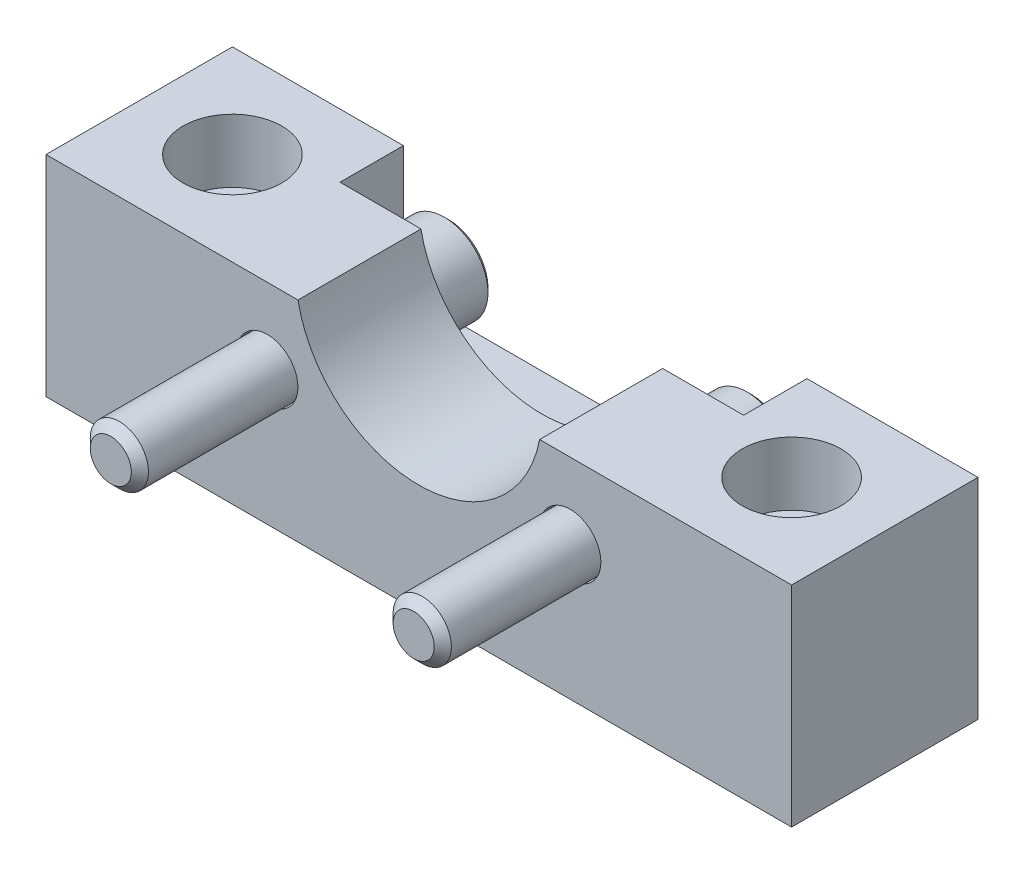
ISO-10303-21;
HEADER;
FILE_DESCRIPTION(('STEP AP214'),'2;1');
FILE_NAME('part.step','',(''),(''),'','','');
FILE_SCHEMA(('AUTOMOTIVE_DESIGN { 1 0 10303 214 1 1 1 1 }'));
ENDSEC;
DATA;
#1=APPLICATION_CONTEXT('core data for automotive mechanical design processes');
#2=APPLICATION_PROTOCOL_DEFINITION('international standard','automotive_design',2000,#1);
#3=PRODUCT_CONTEXT('',#1,'mechanical');
#4=PRODUCT('Part','Part','',(#3));
#5=PRODUCT_RELATED_PRODUCT_CATEGORY('part','',(#4));
#6=PRODUCT_DEFINITION_FORMATION('','',#4);
#7=PRODUCT_DEFINITION_CONTEXT('part definition',#1,'design');
#8=PRODUCT_DEFINITION('design','',#6,#7);
#9=PRODUCT_DEFINITION_SHAPE('','',#8);
#10=(LENGTH_UNIT() NAMED_UNIT(*) SI_UNIT(.MILLI.,.METRE.));
#11=(NAMED_UNIT(*) PLANE_ANGLE_UNIT() SI_UNIT($,.RADIAN.));
#12=(NAMED_UNIT(*) SI_UNIT($,.STERADIAN.) SOLID_ANGLE_UNIT());
#13=UNCERTAINTY_MEASURE_WITH_UNIT(LENGTH_MEASURE(1.E-05),#10,'distance_accuracy_value','');
#14=(GEOMETRIC_REPRESENTATION_CONTEXT(3) GLOBAL_UNCERTAINTY_ASSIGNED_CONTEXT((#13)) GLOBAL_UNIT_ASSIGNED_CONTEXT((#10,
#11,#12)) REPRESENTATION_CONTEXT('',''));
#15=CARTESIAN_POINT('',(0.,0.,0.));
#16=DIRECTION('',(0.,0.,1.));
#17=DIRECTION('',(1.,0.,0.));
#18=AXIS2_PLACEMENT_3D('',#15,#16,#17);
#19=CARTESIAN_POINT('',(-15.138238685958,-26.1874000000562,-20.8661));
#20=DIRECTION('',(0.,0.,1.));
#21=DIRECTION('',(0.5,0.866025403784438,0.));
#22=AXIS2_PLACEMENT_3D('',#19,#20,#21);
#23=PLANE('',#22);
#24=DIRECTION('',(-0.5,-0.866025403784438,0.));
#25=VECTOR('',#24,1.);
#26=CARTESIAN_POINT('',(-16.9713257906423,-29.3624000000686,-20.8661));
#27=LINE('',#26,#25);
#28=CARTESIAN_POINT('',(-16.9713257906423,-29.3624000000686,-20.8661));
#29=VERTEX_POINT('',#28);
#30=CARTESIAN_POINT('',(-18.8044128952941,-32.537400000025,-20.8661));
#31=VERTEX_POINT('',#30);
#32=EDGE_CURVE('E393',#29,#31,#27,.T.);
#33=ORIENTED_EDGE('',*,*,#32,.T.);
#34=DIRECTION('',(-1.,0.,0.));
#35=VECTOR('',#34,1.);
#36=CARTESIAN_POINT('',(-18.8044128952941,-32.537400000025,-20.8661));
#37=LINE('',#36,#35);
#38=CARTESIAN_POINT('',(-22.4705871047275,-32.537400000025,-20.8661));
#39=VERTEX_POINT('',#38);
#40=EDGE_CURVE('E396',#31,#39,#37,.T.);
#41=ORIENTED_EDGE('',*,*,#40,.T.);
#42=DIRECTION('',(-0.5,0.866025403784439,0.));
#43=VECTOR('',#42,1.);
#44=CARTESIAN_POINT('',(-22.4705871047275,-32.537400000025,-20.8661));
#45=LINE('',#44,#43);
#46=CARTESIAN_POINT('',(-24.3036742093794,-29.3624000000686,-20.8661));
#47=VERTEX_POINT('',#46);
#48=EDGE_CURVE('E399',#39,#47,#45,.T.);
#49=ORIENTED_EDGE('',*,*,#48,.T.);
#50=DIRECTION('',(0.5,0.866025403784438,0.));
#51=VECTOR('',#50,1.);
#52=CARTESIAN_POINT('',(-24.3036742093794,-29.3624000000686,-20.8661));
#53=LINE('',#52,#51);
#54=CARTESIAN_POINT('',(-22.4705871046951,-26.1874000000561,-20.8661));
#55=VERTEX_POINT('',#54);
#56=EDGE_CURVE('E402',#47,#55,#53,.T.);
#57=ORIENTED_EDGE('',*,*,#56,.T.);
#58=DIRECTION('',(1.,0.,0.));
#59=VECTOR('',#58,1.);
#60=CARTESIAN_POINT('',(-22.4705871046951,-26.1874000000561,-20.8661));
#61=LINE('',#60,#59);
#62=CARTESIAN_POINT('',(-18.8044128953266,-26.1874000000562,-20.8661));
#63=VERTEX_POINT('',#62);
#64=EDGE_CURVE('E405',#55,#63,#61,.T.);
#65=ORIENTED_EDGE('',*,*,#64,.T.);
#66=DIRECTION('',(0.5,-0.866025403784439,0.));
#67=VECTOR('',#66,1.);
#68=CARTESIAN_POINT('',(-18.8044128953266,-26.1874000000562,-20.8661));
#69=LINE('',#68,#67);
#70=EDGE_CURVE('E408',#63,#29,#69,.T.);
#71=ORIENTED_EDGE('',*,*,#70,.T.);
#72=EDGE_LOOP('',(#33,#41,#49,#57,#65,#71));
#73=FACE_BOUND('',#72,.T.);
#74=ADVANCED_FACE('F14',(#73),#23,.F.);
#75=CARTESIAN_POINT('',(-18.8044128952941,-32.537400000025,-20.8661));
#76=DIRECTION('',(0.,-1.,0.));
#77=DIRECTION('',(-1.,0.,0.));
#78=AXIS2_PLACEMENT_3D('',#75,#76,#77);
#79=PLANE('',#78);
#80=DIRECTION('',(-1.,0.,0.));
#81=VECTOR('',#80,1.);
#82=CARTESIAN_POINT('',(-18.8044128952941,-32.537400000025,-24.7015));
#83=LINE('',#82,#81);
#84=CARTESIAN_POINT('',(-18.8044128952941,-32.537400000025,-24.7015));
#85=VERTEX_POINT('',#84);
#86=CARTESIAN_POINT('',(-22.4705871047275,-32.537400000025,-24.7015));
#87=VERTEX_POINT('',#86);
#88=EDGE_CURVE('E379',#85,#87,#83,.T.);
#89=ORIENTED_EDGE('',*,*,#88,.T.);
#90=DIRECTION('',(0.,0.,-1.));
#91=VECTOR('',#90,1.);
#92=CARTESIAN_POINT('',(-22.4705871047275,-32.537400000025,-20.8661));
#93=LINE('',#92,#91);
#94=EDGE_CURVE('E420',#39,#87,#93,.T.);
#95=ORIENTED_EDGE('',*,*,#94,.F.);
#96=ORIENTED_EDGE('',*,*,#40,.F.);
#97=DIRECTION('',(0.,0.,-1.));
#98=VECTOR('',#97,1.);
#99=CARTESIAN_POINT('',(-18.8044128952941,-32.537400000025,-20.8661));
#100=LINE('',#99,#98);
#101=EDGE_CURVE('E411',#31,#85,#100,.T.);
#102=ORIENTED_EDGE('',*,*,#101,.T.);
#103=EDGE_LOOP('',(#89,#95,#96,#102));
#104=FACE_BOUND('',#103,.T.);
#105=ADVANCED_FACE('F973',(#104),#79,.F.);
#106=CARTESIAN_POINT('',(-22.4705871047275,-32.537400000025,-20.8661));
#107=DIRECTION('',(-0.86602540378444,-0.5,0.));
#108=DIRECTION('',(-0.5,0.866025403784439,0.));
#109=AXIS2_PLACEMENT_3D('',#106,#107,#108);
#110=PLANE('',#109);
#111=DIRECTION('',(-0.5,0.866025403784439,0.));
#112=VECTOR('',#111,1.);
#113=CARTESIAN_POINT('',(-22.4705871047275,-32.537400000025,-24.7015));
#114=LINE('',#113,#112);
#115=CARTESIAN_POINT('',(-24.3036742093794,-29.3624000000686,-24.7015));
#116=VERTEX_POINT('',#115);
#117=EDGE_CURVE('E382',#87,#116,#114,.T.);
#118=ORIENTED_EDGE('',*,*,#117,.T.);
#119=DIRECTION('',(0.,0.,-1.));
#120=VECTOR('',#119,1.);
#121=CARTESIAN_POINT('',(-24.3036742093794,-29.3624000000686,-20.8661));
#122=LINE('',#121,#120);
#123=EDGE_CURVE('E418',#47,#116,#122,.T.);
#124=ORIENTED_EDGE('',*,*,#123,.F.);
#125=ORIENTED_EDGE('',*,*,#48,.F.);
#126=ORIENTED_EDGE('',*,*,#94,.T.);
#127=EDGE_LOOP('',(#118,#124,#125,#126));
#128=FACE_BOUND('',#127,.T.);
#129=ADVANCED_FACE('F1003',(#128),#110,.F.);
#130=CARTESIAN_POINT('',(-24.3036742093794,-29.3624000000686,-20.8661));
#131=DIRECTION('',(-0.866025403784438,0.5,0.));
#132=DIRECTION('',(0.5,0.866025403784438,0.));
#133=AXIS2_PLACEMENT_3D('',#130,#131,#132);
#134=PLANE('',#133);
#135=DIRECTION('',(0.5,0.866025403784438,0.));
#136=VECTOR('',#135,1.);
#137=CARTESIAN_POINT('',(-24.3036742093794,-29.3624000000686,-24.7015));
#138=LINE('',#137,#136);
#139=CARTESIAN_POINT('',(-22.4705871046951,-26.1874000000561,-24.7015));
#140=VERTEX_POINT('',#139);
#141=EDGE_CURVE('E385',#116,#140,#138,.T.);
#142=ORIENTED_EDGE('',*,*,#141,.T.);
#143=DIRECTION('',(0.,0.,-1.));
#144=VECTOR('',#143,1.);
#145=CARTESIAN_POINT('',(-22.4705871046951,-26.1874000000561,-20.8661));
#146=LINE('',#145,#144);
#147=EDGE_CURVE('E416',#55,#140,#146,.T.);
#148=ORIENTED_EDGE('',*,*,#147,.F.);
#149=ORIENTED_EDGE('',*,*,#56,.F.);
#150=ORIENTED_EDGE('',*,*,#123,.T.);
#151=EDGE_LOOP('',(#142,#148,#149,#150));
#152=FACE_BOUND('',#151,.T.);
#153=ADVANCED_FACE('F993',(#152),#134,.F.);
#154=CARTESIAN_POINT('',(-22.4705871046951,-26.1874000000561,-20.8661));
#155=DIRECTION('',(0.,1.,0.));
#156=DIRECTION('',(1.,0.,0.));
#157=AXIS2_PLACEMENT_3D('',#154,#155,#156);
#158=PLANE('',#157);
#159=DIRECTION('',(1.,0.,0.));
#160=VECTOR('',#159,1.);
#161=CARTESIAN_POINT('',(-22.4705871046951,-26.1874000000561,-24.7015));
#162=LINE('',#161,#160);
#163=CARTESIAN_POINT('',(-18.8044128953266,-26.1874000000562,-24.7015));
#164=VERTEX_POINT('',#163);
#165=EDGE_CURVE('E388',#140,#164,#162,.T.);
#166=ORIENTED_EDGE('',*,*,#165,.T.);
#167=DIRECTION('',(0.,0.,-1.));
#168=VECTOR('',#167,1.);
#169=CARTESIAN_POINT('',(-18.8044128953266,-26.1874000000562,-20.8661));
#170=LINE('',#169,#168);
#171=EDGE_CURVE('E414',#63,#164,#170,.T.);
#172=ORIENTED_EDGE('',*,*,#171,.F.);
#173=ORIENTED_EDGE('',*,*,#64,.F.);
#174=ORIENTED_EDGE('',*,*,#147,.T.);
#175=EDGE_LOOP('',(#166,#172,#173,#174));
#176=FACE_BOUND('',#175,.T.);
#177=ADVANCED_FACE('F984',(#176),#158,.F.);
#178=CARTESIAN_POINT('',(-18.8044128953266,-26.1874000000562,-20.8661));
#179=DIRECTION('',(0.86602540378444,0.5,0.));
#180=DIRECTION('',(0.5,-0.866025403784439,0.));
#181=AXIS2_PLACEMENT_3D('',#178,#179,#180);
#182=PLANE('',#181);
#183=DIRECTION('',(0.5,-0.866025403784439,0.));
#184=VECTOR('',#183,1.);
#185=CARTESIAN_POINT('',(-18.8044128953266,-26.1874000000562,-24.7015));
#186=LINE('',#185,#184);
#187=CARTESIAN_POINT('',(-16.9713257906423,-29.3624000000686,-24.7015));
#188=VERTEX_POINT('',#187);
#189=EDGE_CURVE('E391',#164,#188,#186,.T.);
#190=ORIENTED_EDGE('',*,*,#189,.T.);
#191=DIRECTION('',(0.,0.,-1.));
#192=VECTOR('',#191,1.);
#193=CARTESIAN_POINT('',(-16.9713257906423,-29.3624000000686,-20.8661));
#194=LINE('',#193,#192);
#195=EDGE_CURVE('E37',#29,#188,#194,.T.);
#196=ORIENTED_EDGE('',*,*,#195,.F.);
#197=ORIENTED_EDGE('',*,*,#70,.F.);
#198=ORIENTED_EDGE('',*,*,#171,.T.);
#199=EDGE_LOOP('',(#190,#196,#197,#198));
#200=FACE_BOUND('',#199,.T.);
#201=ADVANCED_FACE('F979',(#200),#182,.F.);
#202=CARTESIAN_POINT('',(-16.9713257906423,-29.3624000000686,-20.8661));
#203=DIRECTION('',(0.866025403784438,-0.5,0.));
#204=DIRECTION('',(-0.5,-0.866025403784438,0.));
#205=AXIS2_PLACEMENT_3D('',#202,#203,#204);
#206=PLANE('',#205);
#207=DIRECTION('',(-0.5,-0.866025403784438,0.));
#208=VECTOR('',#207,1.);
#209=CARTESIAN_POINT('',(-16.9713257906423,-29.3624000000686,-24.7015));
#210=LINE('',#209,#208);
#211=EDGE_CURVE('E30',#188,#85,#210,.T.);
#212=ORIENTED_EDGE('',*,*,#211,.T.);
#213=ORIENTED_EDGE('',*,*,#101,.F.);
#214=ORIENTED_EDGE('',*,*,#32,.F.);
#215=ORIENTED_EDGE('',*,*,#195,.T.);
#216=EDGE_LOOP('',(#212,#213,#214,#215));
#217=FACE_BOUND('',#216,.T.);
#218=ADVANCED_FACE('F559',(#217),#206,.F.);
#219=CARTESIAN_POINT('',(-25.2779966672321,-26.683208,-24.7015));
#220=DIRECTION('',(0.,0.,-1.));
#221=DIRECTION('',(-0.5,-0.866025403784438,0.));
#222=AXIS2_PLACEMENT_3D('',#219,#220,#221);
#223=PLANE('',#222);
#224=ORIENTED_EDGE('',*,*,#211,.F.);
#225=ORIENTED_EDGE('',*,*,#189,.F.);
#226=ORIENTED_EDGE('',*,*,#165,.F.);
#227=ORIENTED_EDGE('',*,*,#141,.F.);
#228=ORIENTED_EDGE('',*,*,#117,.F.);
#229=ORIENTED_EDGE('',*,*,#88,.F.);
#230=EDGE_LOOP('',(#224,#225,#226,#227,#228,#229));
#231=FACE_BOUND('',#230,.T.);
#232=CARTESIAN_POINT('',(-20.6375,-29.3624,-24.7015));
#233=DIRECTION('',(0.,0.,1.));
#234=DIRECTION('',(0.5,0.866025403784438,0.));
#235=AXIS2_PLACEMENT_3D('',#232,#233,#234);
#236=CIRCLE('',#235,5.358384);
#237=CARTESIAN_POINT('',(-17.958308,-24.7219033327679,-24.7015));
#238=VERTEX_POINT('',#237);
#239=EDGE_CURVE('E428',#238,#238,#236,.T.);
#240=ORIENTED_EDGE('',*,*,#239,.F.);
#241=EDGE_LOOP('',(#240));
#242=FACE_BOUND('',#241,.T.);
#243=ADVANCED_FACE('F565',(#231,#242),#223,.T.);
#244=CARTESIAN_POINT('',(-20.6375,-29.3624,-24.106124));
#245=DIRECTION('',(0.,0.,1.));
#246=DIRECTION('',(0.5,0.866025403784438,0.));
#247=AXIS2_PLACEMENT_3D('',#244,#245,#246);
#248=CONICAL_SURFACE('',#247,5.95376,0.785398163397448);
#249=ORIENTED_EDGE('',*,*,#239,.T.);
#250=EDGE_LOOP('',(#249));
#251=FACE_BOUND('',#250,.T.);
#252=CARTESIAN_POINT('',(-20.6375,-29.3624,-24.106124));
#253=DIRECTION('',(0.,0.,1.));
#254=DIRECTION('',(0.5,0.866025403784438,0.));
#255=AXIS2_PLACEMENT_3D('',#252,#253,#254);
#256=CIRCLE('',#255,5.95376);
#257=CARTESIAN_POINT('',(-17.66062,-24.2062925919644,-24.106124));
#258=VERTEX_POINT('',#257);
#259=EDGE_CURVE('E431',#258,#258,#256,.T.);
#260=ORIENTED_EDGE('',*,*,#259,.F.);
#261=EDGE_LOOP('',(#260));
#262=FACE_BOUND('',#261,.T.);
#263=ADVANCED_FACE('F568',(#251,#262),#248,.T.);
#264=CARTESIAN_POINT('',(-20.6375,-29.3624,-16.764));
#265=DIRECTION('',(0.,0.,1.));
#266=DIRECTION('',(0.5,0.866025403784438,0.));
#267=AXIS2_PLACEMENT_3D('',#264,#265,#266);
#268=CYLINDRICAL_SURFACE('',#267,5.95376);
#269=ORIENTED_EDGE('',*,*,#259,.T.);
#270=EDGE_LOOP('',(#269));
#271=FACE_BOUND('',#270,.T.);
#272=CARTESIAN_POINT('',(-20.6375,-29.3624,-16.764));
#273=DIRECTION('',(0.,0.,1.));
#274=DIRECTION('',(0.5,0.866025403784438,0.));
#275=AXIS2_PLACEMENT_3D('',#272,#273,#274);
#276=CIRCLE('',#275,5.95376);
#277=CARTESIAN_POINT('',(-17.66062,-24.2062925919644,-16.764));
#278=VERTEX_POINT('',#277);
#279=EDGE_CURVE('E433',#278,#278,#276,.T.);
#280=ORIENTED_EDGE('',*,*,#279,.F.);
#281=EDGE_LOOP('',(#280));
#282=FACE_BOUND('',#281,.T.);
#283=ADVANCED_FACE('F446',(#271,#282),#268,.T.);
#284=CARTESIAN_POINT('',(-20.6375,-29.3624,-16.764));
#285=DIRECTION('',(0.,0.,1.));
#286=DIRECTION('',(0.5,0.866025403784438,0.));
#287=AXIS2_PLACEMENT_3D('',#284,#285,#286);
#288=PLANE('',#287);
#289=CARTESIAN_POINT('',(-20.6375,-29.3624,-16.764));
#290=DIRECTION('',(0.,0.,1.));
#291=DIRECTION('',(0.5,0.866025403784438,0.));
#292=AXIS2_PLACEMENT_3D('',#289,#290,#291);
#293=CIRCLE('',#292,3.96875);
#294=CARTESIAN_POINT('',(-18.653125,-25.9253616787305,-16.764));
#295=VERTEX_POINT('',#294);
#296=EDGE_CURVE('E18',#295,#295,#293,.T.);
#297=ORIENTED_EDGE('',*,*,#296,.F.);
#298=EDGE_LOOP('',(#297));
#299=FACE_BOUND('',#298,.T.);
#300=CARTESIAN_POINT('',(-20.6375,-29.3624,-16.764));
#301=DIRECTION('',(0.,0.,-1.));
#302=DIRECTION('',(-1.,0.,0.));
#303=AXIS2_PLACEMENT_3D('',#300,#301,#302);
#304=CIRCLE('',#303,4.1656);
#305=CARTESIAN_POINT('',(-24.8031,-29.3624,-16.764));
#306=VERTEX_POINT('',#305);
#307=EDGE_CURVE('E9',#306,#306,#304,.F.);
#308=ORIENTED_EDGE('',*,*,#307,.T.);
#309=EDGE_LOOP('',(#308));
#310=FACE_BOUND('',#309,.T.);
#311=ADVANCED_FACE('F16',(#299,#310),#288,.T.);
#312=CARTESIAN_POINT('',(-20.6375,-29.3624,21.336));
#313=DIRECTION('',(0.,0.,1.));
#314=DIRECTION('',(0.5,0.866025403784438,0.));
#315=AXIS2_PLACEMENT_3D('',#312,#313,#314);
#316=PLANE('',#315);
#317=CARTESIAN_POINT('',(-20.6375,-29.3624,21.336));
#318=DIRECTION('',(0.,0.,1.));
#319=DIRECTION('',(0.5,0.866025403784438,0.));
#320=AXIS2_PLACEMENT_3D('',#317,#318,#319);
#321=CIRCLE('',#320,2.79768935);
#322=CARTESIAN_POINT('',(-19.238655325,-26.9395299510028,21.336));
#323=VERTEX_POINT('',#322);
#324=EDGE_CURVE('E425',#323,#323,#321,.T.);
#325=ORIENTED_EDGE('',*,*,#324,.T.);
#326=EDGE_LOOP('',(#325));
#327=FACE_BOUND('',#326,.T.);
#328=ADVANCED_FACE('F445',(#327),#316,.T.);
#329=CARTESIAN_POINT('',(-20.6375,-29.3624,21.336));
#330=DIRECTION('',(0.,0.,-1.));
#331=DIRECTION('',(-0.5,-0.866025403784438,0.));
#332=AXIS2_PLACEMENT_3D('',#329,#330,#331);
#333=CONICAL_SURFACE('',#332,2.79768935,0.785398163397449);
#334=CARTESIAN_POINT('',(-20.6375,-29.3624,20.16493935));
#335=DIRECTION('',(0.,0.,1.));
#336=DIRECTION('',(0.5,0.866025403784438,0.));
#337=AXIS2_PLACEMENT_3D('',#334,#335,#336);
#338=CIRCLE('',#337,3.96875);
#339=CARTESIAN_POINT('',(-18.653125,-25.9253616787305,20.16493935));
#340=VERTEX_POINT('',#339);
#341=EDGE_CURVE('E413',#340,#340,#338,.T.);
#342=ORIENTED_EDGE('',*,*,#341,.T.);
#343=EDGE_LOOP('',(#342));
#344=FACE_BOUND('',#343,.T.);
#345=ORIENTED_EDGE('',*,*,#324,.F.);
#346=EDGE_LOOP('',(#345));
#347=FACE_BOUND('',#346,.T.);
#348=ADVANCED_FACE('F549',(#344,#347),#333,.T.);
#349=CARTESIAN_POINT('',(-20.6375,-29.3624,-16.764));
#350=DIRECTION('',(0.,0.,1.));
#351=DIRECTION('',(0.5,0.866025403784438,0.));
#352=AXIS2_PLACEMENT_3D('',#349,#350,#351);
#353=CYLINDRICAL_SURFACE('',#352,3.96875);
#354=ORIENTED_EDGE('',*,*,#296,.T.);
#355=EDGE_LOOP('',(#354));
#356=FACE_BOUND('',#355,.T.);
#357=ORIENTED_EDGE('',*,*,#341,.F.);
#358=EDGE_LOOP('',(#357));
#359=FACE_BOUND('',#358,.T.);
#360=ADVANCED_FACE('F440',(#356,#359),#353,.T.);
#361=CARTESIAN_POINT('',(20.6375,-29.3624,21.336));
#362=DIRECTION('',(0.,0.,1.));
#363=DIRECTION('',(0.5,0.866025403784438,0.));
#364=AXIS2_PLACEMENT_3D('',#361,#362,#363);
#365=PLANE('',#364);
#366=CARTESIAN_POINT('',(20.6375,-29.3624,21.336));
#367=DIRECTION('',(0.,0.,1.));
#368=DIRECTION('',(0.5,0.866025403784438,0.));
#369=AXIS2_PLACEMENT_3D('',#366,#367,#368);
#370=CIRCLE('',#369,2.79768935);
#371=CARTESIAN_POINT('',(22.036344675,-26.9395299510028,21.336));
#372=VERTEX_POINT('',#371);
#373=EDGE_CURVE('E240',#372,#372,#370,.T.);
#374=ORIENTED_EDGE('',*,*,#373,.T.);
#375=EDGE_LOOP('',(#374));
#376=FACE_BOUND('',#375,.T.);
#377=ADVANCED_FACE('F529',(#376),#365,.T.);
#378=CARTESIAN_POINT('',(20.6375,-29.3624,21.336));
#379=DIRECTION('',(0.,0.,-1.));
#380=DIRECTION('',(-0.5,-0.866025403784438,0.));
#381=AXIS2_PLACEMENT_3D('',#378,#379,#380);
#382=CONICAL_SURFACE('',#381,2.79768935,0.785398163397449);
#383=CARTESIAN_POINT('',(20.6375,-29.3624,20.16493935));
#384=DIRECTION('',(0.,0.,1.));
#385=DIRECTION('',(0.5,0.866025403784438,0.));
#386=AXIS2_PLACEMENT_3D('',#383,#384,#385);
#387=CIRCLE('',#386,3.96875);
#388=CARTESIAN_POINT('',(22.621875,-25.9253616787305,20.16493935));
#389=VERTEX_POINT('',#388);
#390=EDGE_CURVE('E231',#389,#389,#387,.T.);
#391=ORIENTED_EDGE('',*,*,#390,.T.);
#392=EDGE_LOOP('',(#391));
#393=FACE_BOUND('',#392,.T.);
#394=ORIENTED_EDGE('',*,*,#373,.F.);
#395=EDGE_LOOP('',(#394));
#396=FACE_BOUND('',#395,.T.);
#397=ADVANCED_FACE('F540',(#393,#396),#382,.T.);
#398=CARTESIAN_POINT('',(26.136761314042,-26.1874000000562,-20.8661));
#399=DIRECTION('',(0.,0.,1.));
#400=DIRECTION('',(0.5,0.866025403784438,0.));
#401=AXIS2_PLACEMENT_3D('',#398,#399,#400);
#402=PLANE('',#401);
#403=DIRECTION('',(-0.5,-0.866025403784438,0.));
#404=VECTOR('',#403,1.);
#405=CARTESIAN_POINT('',(24.3036742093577,-29.3624000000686,-20.8661));
#406=LINE('',#405,#404);
#407=CARTESIAN_POINT('',(24.3036742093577,-29.3624000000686,-20.8661));
#408=VERTEX_POINT('',#407);
#409=CARTESIAN_POINT('',(22.4705871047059,-32.537400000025,-20.8661));
#410=VERTEX_POINT('',#409);
#411=EDGE_CURVE('E214',#408,#410,#406,.T.);
#412=ORIENTED_EDGE('',*,*,#411,.T.);
#413=DIRECTION('',(-1.,0.,0.));
#414=VECTOR('',#413,1.);
#415=CARTESIAN_POINT('',(22.4705871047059,-32.537400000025,-20.8661));
#416=LINE('',#415,#414);
#417=CARTESIAN_POINT('',(18.8044128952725,-32.537400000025,-20.8661));
#418=VERTEX_POINT('',#417);
#419=EDGE_CURVE('E217',#410,#418,#416,.T.);
#420=ORIENTED_EDGE('',*,*,#419,.T.);
#421=DIRECTION('',(-0.5,0.866025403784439,0.));
#422=VECTOR('',#421,1.);
#423=CARTESIAN_POINT('',(18.8044128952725,-32.537400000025,-20.8661));
#424=LINE('',#423,#422);
#425=CARTESIAN_POINT('',(16.9713257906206,-29.3624000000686,-20.8661));
#426=VERTEX_POINT('',#425);
#427=EDGE_CURVE('E184',#418,#426,#424,.T.);
#428=ORIENTED_EDGE('',*,*,#427,.T.);
#429=DIRECTION('',(0.5,0.866025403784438,0.));
#430=VECTOR('',#429,1.);
#431=CARTESIAN_POINT('',(16.9713257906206,-29.3624000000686,-20.8661));
#432=LINE('',#431,#430);
#433=CARTESIAN_POINT('',(18.804412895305,-26.1874000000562,-20.8661));
#434=VERTEX_POINT('',#433);
#435=EDGE_CURVE('E220',#426,#434,#432,.T.);
#436=ORIENTED_EDGE('',*,*,#435,.T.);
#437=DIRECTION('',(1.,0.,0.));
#438=VECTOR('',#437,1.);
#439=CARTESIAN_POINT('',(18.804412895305,-26.1874000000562,-20.8661));
#440=LINE('',#439,#438);
#441=CARTESIAN_POINT('',(22.4705871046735,-26.1874000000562,-20.8661));
#442=VERTEX_POINT('',#441);
#443=EDGE_CURVE('E223',#434,#442,#440,.T.);
#444=ORIENTED_EDGE('',*,*,#443,.T.);
#445=DIRECTION('',(0.5,-0.866025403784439,0.));
#446=VECTOR('',#445,1.);
#447=CARTESIAN_POINT('',(22.4705871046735,-26.1874000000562,-20.8661));
#448=LINE('',#447,#446);
#449=EDGE_CURVE('E226',#442,#408,#448,.T.);
#450=ORIENTED_EDGE('',*,*,#449,.T.);
#451=EDGE_LOOP('',(#412,#420,#428,#436,#444,#450));
#452=FACE_BOUND('',#451,.T.);
#453=ADVANCED_FACE('F503',(#452),#402,.F.);
#454=CARTESIAN_POINT('',(20.6375,-29.3624,-16.764));
#455=DIRECTION('',(0.,0.,1.));
#456=DIRECTION('',(0.5,0.866025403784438,0.));
#457=AXIS2_PLACEMENT_3D('',#454,#455,#456);
#458=CYLINDRICAL_SURFACE('',#457,3.96875);
#459=CARTESIAN_POINT('',(20.6375,-29.3624,-16.764));
#460=DIRECTION('',(0.,0.,1.));
#461=DIRECTION('',(0.5,0.866025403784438,0.));
#462=AXIS2_PLACEMENT_3D('',#459,#460,#461);
#463=CIRCLE('',#462,3.96875);
#464=CARTESIAN_POINT('',(22.621875,-25.9253616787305,-16.764));
#465=VERTEX_POINT('',#464);
#466=EDGE_CURVE('E249',#465,#465,#463,.T.);
#467=ORIENTED_EDGE('',*,*,#466,.T.);
#468=EDGE_LOOP('',(#467));
#469=FACE_BOUND('',#468,.T.);
#470=ORIENTED_EDGE('',*,*,#390,.F.);
#471=EDGE_LOOP('',(#470));
#472=FACE_BOUND('',#471,.T.);
#473=ADVANCED_FACE('F536',(#469,#472),#458,.T.);
#474=CARTESIAN_POINT('',(22.4705871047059,-32.537400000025,-20.8661));
#475=DIRECTION('',(0.,-1.,0.));
#476=DIRECTION('',(-1.,0.,0.));
#477=AXIS2_PLACEMENT_3D('',#474,#475,#476);
#478=PLANE('',#477);
#479=DIRECTION('',(-1.,0.,0.));
#480=VECTOR('',#479,1.);
#481=CARTESIAN_POINT('',(22.4705871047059,-32.537400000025,-24.7015));
#482=LINE('',#481,#480);
#483=CARTESIAN_POINT('',(22.4705871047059,-32.537400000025,-24.7015));
#484=VERTEX_POINT('',#483);
#485=CARTESIAN_POINT('',(18.8044128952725,-32.537400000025,-24.7015));
#486=VERTEX_POINT('',#485);
#487=EDGE_CURVE('E193',#484,#486,#482,.T.);
#488=ORIENTED_EDGE('',*,*,#487,.T.);
#489=DIRECTION('',(0.,0.,-1.));
#490=VECTOR('',#489,1.);
#491=CARTESIAN_POINT('',(18.8044128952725,-32.537400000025,-20.8661));
#492=LINE('',#491,#490);
#493=EDGE_CURVE('E177',#418,#486,#492,.T.);
#494=ORIENTED_EDGE('',*,*,#493,.F.);
#495=ORIENTED_EDGE('',*,*,#419,.F.);
#496=DIRECTION('',(0.,0.,-1.));
#497=VECTOR('',#496,1.);
#498=CARTESIAN_POINT('',(22.4705871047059,-32.537400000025,-20.8661));
#499=LINE('',#498,#497);
#500=EDGE_CURVE('E189',#410,#484,#499,.T.);
#501=ORIENTED_EDGE('',*,*,#500,.T.);
#502=EDGE_LOOP('',(#488,#494,#495,#501));
#503=FACE_BOUND('',#502,.T.);
#504=ADVANCED_FACE('F194',(#503),#478,.F.);
#505=CARTESIAN_POINT('',(18.8044128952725,-32.537400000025,-20.8661));
#506=DIRECTION('',(-0.86602540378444,-0.5,0.));
#507=DIRECTION('',(-0.5,0.866025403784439,0.));
#508=AXIS2_PLACEMENT_3D('',#505,#506,#507);
#509=PLANE('',#508);
#510=DIRECTION('',(-0.5,0.866025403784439,0.));
#511=VECTOR('',#510,1.);
#512=CARTESIAN_POINT('',(18.8044128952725,-32.537400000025,-24.7015));
#513=LINE('',#512,#511);
#514=CARTESIAN_POINT('',(16.9713257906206,-29.3624000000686,-24.7015));
#515=VERTEX_POINT('',#514);
#516=EDGE_CURVE('E181',#486,#515,#513,.T.);
#517=ORIENTED_EDGE('',*,*,#516,.T.);
#518=DIRECTION('',(0.,0.,-1.));
#519=VECTOR('',#518,1.);
#520=CARTESIAN_POINT('',(16.9713257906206,-29.3624000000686,-20.8661));
#521=LINE('',#520,#519);
#522=EDGE_CURVE('E188',#426,#515,#521,.T.);
#523=ORIENTED_EDGE('',*,*,#522,.F.);
#524=ORIENTED_EDGE('',*,*,#427,.F.);
#525=ORIENTED_EDGE('',*,*,#493,.T.);
#526=EDGE_LOOP('',(#517,#523,#524,#525));
#527=FACE_BOUND('',#526,.T.);
#528=ADVANCED_FACE('F179',(#527),#509,.F.);
#529=CARTESIAN_POINT('',(16.9713257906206,-29.3624000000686,-20.8661));
#530=DIRECTION('',(-0.866025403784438,0.5,0.));
#531=DIRECTION('',(0.5,0.866025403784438,0.));
#532=AXIS2_PLACEMENT_3D('',#529,#530,#531);
#533=PLANE('',#532);
#534=DIRECTION('',(0.5,0.866025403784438,0.));
#535=VECTOR('',#534,1.);
#536=CARTESIAN_POINT('',(16.9713257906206,-29.3624000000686,-24.7015));
#537=LINE('',#536,#535);
#538=CARTESIAN_POINT('',(18.804412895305,-26.1874000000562,-24.7015));
#539=VERTEX_POINT('',#538);
#540=EDGE_CURVE('E203',#515,#539,#537,.T.);
#541=ORIENTED_EDGE('',*,*,#540,.T.);
#542=DIRECTION('',(0.,0.,-1.));
#543=VECTOR('',#542,1.);
#544=CARTESIAN_POINT('',(18.804412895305,-26.1874000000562,-20.8661));
#545=LINE('',#544,#543);
#546=EDGE_CURVE('E234',#434,#539,#545,.T.);
#547=ORIENTED_EDGE('',*,*,#546,.F.);
#548=ORIENTED_EDGE('',*,*,#435,.F.);
#549=ORIENTED_EDGE('',*,*,#522,.T.);
#550=EDGE_LOOP('',(#541,#547,#548,#549));
#551=FACE_BOUND('',#550,.T.);
#552=ADVANCED_FACE('F645',(#551),#533,.F.);
#553=CARTESIAN_POINT('',(18.804412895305,-26.1874000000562,-20.8661));
#554=DIRECTION('',(0.,1.,0.));
#555=DIRECTION('',(1.,0.,0.));
#556=AXIS2_PLACEMENT_3D('',#553,#554,#555);
#557=PLANE('',#556);
#558=DIRECTION('',(1.,0.,0.));
#559=VECTOR('',#558,1.);
#560=CARTESIAN_POINT('',(18.804412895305,-26.1874000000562,-24.7015));
#561=LINE('',#560,#559);
#562=CARTESIAN_POINT('',(22.4705871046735,-26.1874000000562,-24.7015));
#563=VERTEX_POINT('',#562);
#564=EDGE_CURVE('E205',#539,#563,#561,.T.);
#565=ORIENTED_EDGE('',*,*,#564,.T.);
#566=DIRECTION('',(0.,0.,-1.));
#567=VECTOR('',#566,1.);
#568=CARTESIAN_POINT('',(22.4705871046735,-26.1874000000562,-20.8661));
#569=LINE('',#568,#567);
#570=EDGE_CURVE('E232',#442,#563,#569,.T.);
#571=ORIENTED_EDGE('',*,*,#570,.F.);
#572=ORIENTED_EDGE('',*,*,#443,.F.);
#573=ORIENTED_EDGE('',*,*,#546,.T.);
#574=EDGE_LOOP('',(#565,#571,#572,#573));
#575=FACE_BOUND('',#574,.T.);
#576=ADVANCED_FACE('F530',(#575),#557,.F.);
#577=CARTESIAN_POINT('',(22.4705871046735,-26.1874000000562,-20.8661));
#578=DIRECTION('',(0.86602540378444,0.5,0.));
#579=DIRECTION('',(0.5,-0.866025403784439,0.));
#580=AXIS2_PLACEMENT_3D('',#577,#578,#579);
#581=PLANE('',#580);
#582=DIRECTION('',(0.5,-0.866025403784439,0.));
#583=VECTOR('',#582,1.);
#584=CARTESIAN_POINT('',(22.4705871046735,-26.1874000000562,-24.7015));
#585=LINE('',#584,#583);
#586=CARTESIAN_POINT('',(24.3036742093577,-29.3624000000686,-24.7015));
#587=VERTEX_POINT('',#586);
#588=EDGE_CURVE('E211',#563,#587,#585,.T.);
#589=ORIENTED_EDGE('',*,*,#588,.T.);
#590=DIRECTION('',(0.,0.,-1.));
#591=VECTOR('',#590,1.);
#592=CARTESIAN_POINT('',(24.3036742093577,-29.3624000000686,-20.8661));
#593=LINE('',#592,#591);
#594=EDGE_CURVE('E229',#408,#587,#593,.T.);
#595=ORIENTED_EDGE('',*,*,#594,.F.);
#596=ORIENTED_EDGE('',*,*,#449,.F.);
#597=ORIENTED_EDGE('',*,*,#570,.T.);
#598=EDGE_LOOP('',(#589,#595,#596,#597));
#599=FACE_BOUND('',#598,.T.);
#600=ADVANCED_FACE('F521',(#599),#581,.F.);
#601=CARTESIAN_POINT('',(24.3036742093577,-29.3624000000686,-20.8661));
#602=DIRECTION('',(0.866025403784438,-0.5,0.));
#603=DIRECTION('',(-0.5,-0.866025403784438,0.));
#604=AXIS2_PLACEMENT_3D('',#601,#602,#603);
#605=PLANE('',#604);
#606=DIRECTION('',(-0.5,-0.866025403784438,0.));
#607=VECTOR('',#606,1.);
#608=CARTESIAN_POINT('',(24.3036742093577,-29.3624000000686,-24.7015));
#609=LINE('',#608,#607);
#610=EDGE_CURVE('E197',#587,#484,#609,.T.);
#611=ORIENTED_EDGE('',*,*,#610,.T.);
#612=ORIENTED_EDGE('',*,*,#500,.F.);
#613=ORIENTED_EDGE('',*,*,#411,.F.);
#614=ORIENTED_EDGE('',*,*,#594,.T.);
#615=EDGE_LOOP('',(#611,#612,#613,#614));
#616=FACE_BOUND('',#615,.T.);
#617=ADVANCED_FACE('F510',(#616),#605,.F.);
#618=CARTESIAN_POINT('',(20.6375,-29.3624,-16.764));
#619=DIRECTION('',(0.,0.,1.));
#620=DIRECTION('',(0.5,0.866025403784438,0.));
#621=AXIS2_PLACEMENT_3D('',#618,#619,#620);
#622=PLANE('',#621);
#623=CARTESIAN_POINT('',(20.6375,-29.3624,-16.764));
#624=DIRECTION('',(0.,0.,-1.));
#625=DIRECTION('',(-1.,0.,0.));
#626=AXIS2_PLACEMENT_3D('',#623,#624,#625);
#627=CIRCLE('',#626,4.1656);
#628=CARTESIAN_POINT('',(16.4719,-29.3624,-16.764));
#629=VERTEX_POINT('',#628);
#630=EDGE_CURVE('E321',#629,#629,#627,.F.);
#631=ORIENTED_EDGE('',*,*,#630,.T.);
#632=EDGE_LOOP('',(#631));
#633=FACE_BOUND('',#632,.T.);
#634=ORIENTED_EDGE('',*,*,#466,.F.);
#635=EDGE_LOOP('',(#634));
#636=FACE_BOUND('',#635,.T.);
#637=ADVANCED_FACE('F520',(#633,#636),#622,.T.);
#638=CARTESIAN_POINT('',(38.1,-19.05,-12.7));
#639=DIRECTION('',(0.,1.,0.));
#640=DIRECTION('',(0.,0.,-1.));
#641=AXIS2_PLACEMENT_3D('',#638,#639,#640);
#642=CYLINDRICAL_SURFACE('',#641,4.1656);
#643=CARTESIAN_POINT('',(38.1,-47.625,-12.7));
#644=DIRECTION('',(0.,1.,0.));
#645=DIRECTION('',(0.,0.,-1.));
#646=AXIS2_PLACEMENT_3D('',#643,#644,#645);
#647=CIRCLE('',#646,4.1656);
#648=CARTESIAN_POINT('',(38.1,-47.625,-16.8656));
#649=VERTEX_POINT('',#648);
#650=EDGE_CURVE('E264',#649,#649,#647,.T.);
#651=ORIENTED_EDGE('',*,*,#650,.F.);
#652=EDGE_LOOP('',(#651));
#653=FACE_BOUND('',#652,.T.);
#654=CARTESIAN_POINT('',(38.1,-27.686,-12.7));
#655=DIRECTION('',(0.,1.,0.));
#656=DIRECTION('',(0.,0.,-1.));
#657=AXIS2_PLACEMENT_3D('',#654,#655,#656);
#658=CIRCLE('',#657,4.1656);
#659=CARTESIAN_POINT('',(38.1,-27.686,-16.8656));
#660=VERTEX_POINT('',#659);
#661=EDGE_CURVE('E267',#660,#660,#658,.T.);
#662=ORIENTED_EDGE('',*,*,#661,.T.);
#663=EDGE_LOOP('',(#662));
#664=FACE_BOUND('',#663,.T.);
#665=ADVANCED_FACE('F517',(#653,#664),#642,.F.);
#666=CARTESIAN_POINT('',(-38.1,-19.05,-12.7));
#667=DIRECTION('',(0.,1.,0.));
#668=DIRECTION('',(0.,0.,-1.));
#669=AXIS2_PLACEMENT_3D('',#666,#667,#668);
#670=CYLINDRICAL_SURFACE('',#669,4.1656);
#671=CARTESIAN_POINT('',(-38.1,-47.625,-12.7));
#672=DIRECTION('',(0.,1.,0.));
#673=DIRECTION('',(0.,0.,-1.));
#674=AXIS2_PLACEMENT_3D('',#671,#672,#673);
#675=CIRCLE('',#674,4.1656);
#676=CARTESIAN_POINT('',(-38.1,-47.625,-16.8656));
#677=VERTEX_POINT('',#676);
#678=EDGE_CURVE('E252',#677,#677,#675,.T.);
#679=ORIENTED_EDGE('',*,*,#678,.F.);
#680=EDGE_LOOP('',(#679));
#681=FACE_BOUND('',#680,.T.);
#682=CARTESIAN_POINT('',(-38.1,-27.686,-12.7));
#683=DIRECTION('',(0.,1.,0.));
#684=DIRECTION('',(0.,0.,-1.));
#685=AXIS2_PLACEMENT_3D('',#682,#683,#684);
#686=CIRCLE('',#685,4.1656);
#687=CARTESIAN_POINT('',(-38.1,-27.686,-16.8656));
#688=VERTEX_POINT('',#687);
#689=EDGE_CURVE('E255',#688,#688,#686,.T.);
#690=ORIENTED_EDGE('',*,*,#689,.T.);
#691=EDGE_LOOP('',(#690));
#692=FACE_BOUND('',#691,.T.);
#693=ADVANCED_FACE('F541',(#681,#692),#670,.F.);
#694=CARTESIAN_POINT('',(-42.2656,-27.686,-12.7));
#695=DIRECTION('',(0.,-1.,0.));
#696=DIRECTION('',(0.,0.,1.));
#697=AXIS2_PLACEMENT_3D('',#694,#695,#696);
#698=PLANE('',#697);
#699=ORIENTED_EDGE('',*,*,#689,.F.);
#700=EDGE_LOOP('',(#699));
#701=FACE_BOUND('',#700,.T.);
#702=CARTESIAN_POINT('',(-38.1,-27.686,-12.7));
#703=DIRECTION('',(0.,1.,0.));
#704=DIRECTION('',(0.,0.,-1.));
#705=AXIS2_PLACEMENT_3D('',#702,#703,#704);
#706=CIRCLE('',#705,6.731);
#707=CARTESIAN_POINT('',(-38.1,-27.686,-19.431));
#708=VERTEX_POINT('',#707);
#709=EDGE_CURVE('E258',#708,#708,#706,.T.);
#710=ORIENTED_EDGE('',*,*,#709,.T.);
#711=EDGE_LOOP('',(#710));
#712=FACE_BOUND('',#711,.T.);
#713=ADVANCED_FACE('F514',(#701,#712),#698,.F.);
#714=CARTESIAN_POINT('',(33.9344,-27.686,-12.7));
#715=DIRECTION('',(0.,-1.,0.));
#716=DIRECTION('',(0.,0.,1.));
#717=AXIS2_PLACEMENT_3D('',#714,#715,#716);
#718=PLANE('',#717);
#719=ORIENTED_EDGE('',*,*,#661,.F.);
#720=EDGE_LOOP('',(#719));
#721=FACE_BOUND('',#720,.T.);
#722=CARTESIAN_POINT('',(38.1,-27.686,-12.7));
#723=DIRECTION('',(0.,1.,0.));
#724=DIRECTION('',(0.,0.,-1.));
#725=AXIS2_PLACEMENT_3D('',#722,#723,#724);
#726=CIRCLE('',#725,6.731);
#727=CARTESIAN_POINT('',(38.1,-27.686,-19.431));
#728=VERTEX_POINT('',#727);
#729=EDGE_CURVE('E270',#728,#728,#726,.T.);
#730=ORIENTED_EDGE('',*,*,#729,.T.);
#731=EDGE_LOOP('',(#730));
#732=FACE_BOUND('',#731,.T.);
#733=ADVANCED_FACE('F506',(#721,#732),#718,.F.);
#734=CARTESIAN_POINT('',(15.9970033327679,-26.683208,-24.7015));
#735=DIRECTION('',(0.,0.,-1.));
#736=DIRECTION('',(-0.5,-0.866025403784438,0.));
#737=AXIS2_PLACEMENT_3D('',#734,#735,#736);
#738=PLANE('',#737);
#739=ORIENTED_EDGE('',*,*,#610,.F.);
#740=ORIENTED_EDGE('',*,*,#588,.F.);
#741=ORIENTED_EDGE('',*,*,#564,.F.);
#742=ORIENTED_EDGE('',*,*,#540,.F.);
#743=ORIENTED_EDGE('',*,*,#516,.F.);
#744=ORIENTED_EDGE('',*,*,#487,.F.);
#745=EDGE_LOOP('',(#739,#740,#741,#742,#743,#744));
#746=FACE_BOUND('',#745,.T.);
#747=CARTESIAN_POINT('',(20.6375,-29.3624,-24.7015));
#748=DIRECTION('',(0.,0.,1.));
#749=DIRECTION('',(0.5,0.866025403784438,0.));
#750=AXIS2_PLACEMENT_3D('',#747,#748,#749);
#751=CIRCLE('',#750,5.358384);
#752=CARTESIAN_POINT('',(23.316692,-24.7219033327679,-24.7015));
#753=VERTEX_POINT('',#752);
#754=EDGE_CURVE('E243',#753,#753,#751,.T.);
#755=ORIENTED_EDGE('',*,*,#754,.F.);
#756=EDGE_LOOP('',(#755));
#757=FACE_BOUND('',#756,.T.);
#758=ADVANCED_FACE('F199',(#746,#757),#738,.T.);
#759=CARTESIAN_POINT('',(20.6375,-29.3624,0.));
#760=DIRECTION('',(0.,0.,-1.));
#761=DIRECTION('',(-1.,0.,0.));
#762=AXIS2_PLACEMENT_3D('',#759,#760,#761);
#763=CYLINDRICAL_SURFACE('',#762,4.1656);
#764=CARTESIAN_POINT('',(20.6375,-29.3624,0.));
#765=DIRECTION('',(0.,0.,-1.));
#766=DIRECTION('',(-1.,0.,0.));
#767=AXIS2_PLACEMENT_3D('',#764,#765,#766);
#768=CIRCLE('',#767,4.1656);
#769=CARTESIAN_POINT('',(16.4719,-29.3624,0.));
#770=VERTEX_POINT('',#769);
#771=EDGE_CURVE('E338',#770,#770,#768,.T.);
#772=ORIENTED_EDGE('',*,*,#771,.F.);
#773=EDGE_LOOP('',(#772));
#774=FACE_BOUND('',#773,.T.);
#775=ORIENTED_EDGE('',*,*,#630,.F.);
#776=EDGE_LOOP('',(#775));
#777=FACE_BOUND('',#776,.T.);
#778=ADVANCED_FACE('F455',(#774,#777),#763,.F.);
#779=CARTESIAN_POINT('',(50.8,-47.625,-25.4));
#780=DIRECTION('',(0.,1.,0.));
#781=DIRECTION('',(0.,0.,-1.));
#782=AXIS2_PLACEMENT_3D('',#779,#780,#781);
#783=PLANE('',#782);
#784=ORIENTED_EDGE('',*,*,#678,.T.);
#785=EDGE_LOOP('',(#784));
#786=FACE_BOUND('',#785,.T.);
#787=ORIENTED_EDGE('',*,*,#650,.T.);
#788=EDGE_LOOP('',(#787));
#789=FACE_BOUND('',#788,.T.);
#790=DIRECTION('',(-1.,0.,0.));
#791=VECTOR('',#790,1.);
#792=CARTESIAN_POINT('',(50.8,-47.625,0.));
#793=LINE('',#792,#791);
#794=CARTESIAN_POINT('',(50.8,-47.625,0.));
#795=VERTEX_POINT('',#794);
#796=CARTESIAN_POINT('',(-50.8,-47.625,0.));
#797=VERTEX_POINT('',#796);
#798=EDGE_CURVE('E344',#795,#797,#793,.T.);
#799=ORIENTED_EDGE('',*,*,#798,.T.);
#800=DIRECTION('',(0.,0.,1.));
#801=VECTOR('',#800,1.);
#802=CARTESIAN_POINT('',(-50.8,-47.625,-25.4));
#803=LINE('',#802,#801);
#804=CARTESIAN_POINT('',(-50.8,-47.625,-25.4));
#805=VERTEX_POINT('',#804);
#806=EDGE_CURVE('E369',#805,#797,#803,.T.);
#807=ORIENTED_EDGE('',*,*,#806,.F.);
#808=DIRECTION('',(-1.,0.,0.));
#809=VECTOR('',#808,1.);
#810=CARTESIAN_POINT('',(50.8,-47.625,-25.4));
#811=LINE('',#810,#809);
#812=CARTESIAN_POINT('',(50.8,-47.625,-25.4));
#813=VERTEX_POINT('',#812);
#814=EDGE_CURVE('E355',#813,#805,#811,.T.);
#815=ORIENTED_EDGE('',*,*,#814,.F.);
#816=DIRECTION('',(0.,0.,1.));
#817=VECTOR('',#816,1.);
#818=CARTESIAN_POINT('',(50.8,-47.625,-25.4));
#819=LINE('',#818,#817);
#820=EDGE_CURVE('E372',#813,#795,#819,.T.);
#821=ORIENTED_EDGE('',*,*,#820,.T.);
#822=EDGE_LOOP('',(#799,#807,#815,#821));
#823=FACE_BOUND('',#822,.T.);
#824=ADVANCED_FACE('F471',(#786,#789,#823),#783,.F.);
#825=CARTESIAN_POINT('',(-50.8,-47.625,-25.4));
#826=DIRECTION('',(1.,0.,0.));
#827=DIRECTION('',(0.,0.,-1.));
#828=AXIS2_PLACEMENT_3D('',#825,#826,#827);
#829=PLANE('',#828);
#830=DIRECTION('',(0.,1.,0.));
#831=VECTOR('',#830,1.);
#832=CARTESIAN_POINT('',(-50.8,-47.625,0.));
#833=LINE('',#832,#831);
#834=CARTESIAN_POINT('',(-50.8,-19.05,0.));
#835=VERTEX_POINT('',#834);
#836=EDGE_CURVE('E346',#797,#835,#833,.T.);
#837=ORIENTED_EDGE('',*,*,#836,.T.);
#838=DIRECTION('',(0.,0.,1.));
#839=VECTOR('',#838,1.);
#840=CARTESIAN_POINT('',(-50.8,-19.05,-25.4));
#841=LINE('',#840,#839);
#842=CARTESIAN_POINT('',(-50.8,-19.05,-25.4));
#843=VERTEX_POINT('',#842);
#844=EDGE_CURVE('E366',#843,#835,#841,.T.);
#845=ORIENTED_EDGE('',*,*,#844,.F.);
#846=DIRECTION('',(0.,1.,0.));
#847=VECTOR('',#846,1.);
#848=CARTESIAN_POINT('',(-50.8,-47.625,-25.4));
#849=LINE('',#848,#847);
#850=EDGE_CURVE('E357',#805,#843,#849,.T.);
#851=ORIENTED_EDGE('',*,*,#850,.F.);
#852=ORIENTED_EDGE('',*,*,#806,.T.);
#853=EDGE_LOOP('',(#837,#845,#851,#852));
#854=FACE_BOUND('',#853,.T.);
#855=ADVANCED_FACE('F733',(#854),#829,.F.);
#856=CARTESIAN_POINT('',(-38.1,-19.05,-12.7));
#857=DIRECTION('',(0.,1.,0.));
#858=DIRECTION('',(0.,0.,-1.));
#859=AXIS2_PLACEMENT_3D('',#856,#857,#858);
#860=CYLINDRICAL_SURFACE('',#859,6.731);
#861=ORIENTED_EDGE('',*,*,#709,.F.);
#862=EDGE_LOOP('',(#861));
#863=FACE_BOUND('',#862,.T.);
#864=CARTESIAN_POINT('',(-38.1,-19.05,-12.7));
#865=DIRECTION('',(0.,1.,0.));
#866=DIRECTION('',(0.,0.,-1.));
#867=AXIS2_PLACEMENT_3D('',#864,#865,#866);
#868=CIRCLE('',#867,6.731);
#869=CARTESIAN_POINT('',(-38.1,-19.05,-19.431));
#870=VERTEX_POINT('',#869);
#871=EDGE_CURVE('E261',#870,#870,#868,.T.);
#872=ORIENTED_EDGE('',*,*,#871,.T.);
#873=EDGE_LOOP('',(#872));
#874=FACE_BOUND('',#873,.T.);
#875=ADVANCED_FACE('F689',(#863,#874),#860,.F.);
#876=CARTESIAN_POINT('',(50.8,-19.05,-25.4));
#877=DIRECTION('',(0.,0.,1.));
#878=DIRECTION('',(1.,0.,0.));
#879=AXIS2_PLACEMENT_3D('',#876,#877,#878);
#880=PLANE('',#879);
#881=CARTESIAN_POINT('',(20.6375,-29.3624,-25.4));
#882=DIRECTION('',(0.,0.,-1.));
#883=DIRECTION('',(-1.,0.,0.));
#884=AXIS2_PLACEMENT_3D('',#881,#882,#883);
#885=CIRCLE('',#884,6.858);
#886=CARTESIAN_POINT('',(27.4955,-29.3624,-25.4));
#887=VERTEX_POINT('',#886);
#888=CARTESIAN_POINT('',(20.6375,-36.2204,-25.4));
#889=VERTEX_POINT('',#888);
#890=EDGE_CURVE('E288',#887,#889,#885,.T.);
#891=ORIENTED_EDGE('',*,*,#890,.F.);
#892=DIRECTION('',(0.,-1.,0.));
#893=VECTOR('',#892,1.);
#894=CARTESIAN_POINT('',(27.4955,-19.05,-25.4));
#895=LINE('',#894,#893);
#896=CARTESIAN_POINT('',(27.4955,-19.05,-25.4));
#897=VERTEX_POINT('',#896);
#898=EDGE_CURVE('E284',#897,#887,#895,.T.);
#899=ORIENTED_EDGE('',*,*,#898,.F.);
#900=DIRECTION('',(1.,0.,0.));
#901=VECTOR('',#900,1.);
#902=CARTESIAN_POINT('',(50.8,-19.05,-25.4));
#903=LINE('',#902,#901);
#904=CARTESIAN_POINT('',(50.8,-19.05,-25.4));
#905=VERTEX_POINT('',#904);
#906=EDGE_CURVE('E359',#897,#905,#903,.T.);
#907=ORIENTED_EDGE('',*,*,#906,.T.);
#908=DIRECTION('',(0.,-1.,0.));
#909=VECTOR('',#908,1.);
#910=CARTESIAN_POINT('',(50.8,-47.625,-25.4));
#911=LINE('',#910,#909);
#912=EDGE_CURVE('E352',#905,#813,#911,.T.);
#913=ORIENTED_EDGE('',*,*,#912,.T.);
#914=ORIENTED_EDGE('',*,*,#814,.T.);
#915=ORIENTED_EDGE('',*,*,#850,.T.);
#916=CARTESIAN_POINT('',(-27.4955,-19.05,-25.4));
#917=VERTEX_POINT('',#916);
#918=EDGE_CURVE('E360',#843,#917,#903,.T.);
#919=ORIENTED_EDGE('',*,*,#918,.T.);
#920=DIRECTION('',(0.,1.,0.));
#921=VECTOR('',#920,1.);
#922=CARTESIAN_POINT('',(-27.4955,-19.05,-25.4));
#923=LINE('',#922,#921);
#924=CARTESIAN_POINT('',(-27.4955,-29.3624,-25.4));
#925=VERTEX_POINT('',#924);
#926=EDGE_CURVE('E297',#925,#917,#923,.T.);
#927=ORIENTED_EDGE('',*,*,#926,.F.);
#928=CARTESIAN_POINT('',(-20.6375,-29.3624,-25.4));
#929=DIRECTION('',(0.,0.,-1.));
#930=DIRECTION('',(-1.,0.,0.));
#931=AXIS2_PLACEMENT_3D('',#928,#929,#930);
#932=CIRCLE('',#931,6.858);
#933=CARTESIAN_POINT('',(-20.6375,-36.2204,-25.4));
#934=VERTEX_POINT('',#933);
#935=EDGE_CURVE('E294',#934,#925,#932,.T.);
#936=ORIENTED_EDGE('',*,*,#935,.F.);
#937=DIRECTION('',(-1.,0.,0.));
#938=VECTOR('',#937,1.);
#939=CARTESIAN_POINT('',(20.6375,-36.2204,-25.4));
#940=LINE('',#939,#938);
#941=EDGE_CURVE('E291',#889,#934,#940,.T.);
#942=ORIENTED_EDGE('',*,*,#941,.F.);
#943=EDGE_LOOP('',(#891,#899,#907,#913,#914,#915,#919,#927,#936,#942));
#944=FACE_BOUND('',#943,.T.);
#945=ADVANCED_FACE('F463',(#944),#880,.F.);
#946=CARTESIAN_POINT('',(50.8,-47.625,-25.4));
#947=DIRECTION('',(-1.,0.,0.));
#948=DIRECTION('',(0.,0.,1.));
#949=AXIS2_PLACEMENT_3D('',#946,#947,#948);
#950=PLANE('',#949);
#951=DIRECTION('',(0.,-1.,0.));
#952=VECTOR('',#951,1.);
#953=CARTESIAN_POINT('',(50.8,-47.625,0.));
#954=LINE('',#953,#952);
#955=CARTESIAN_POINT('',(50.8,-19.05,0.));
#956=VERTEX_POINT('',#955);
#957=EDGE_CURVE('E341',#956,#795,#954,.T.);
#958=ORIENTED_EDGE('',*,*,#957,.T.);
#959=ORIENTED_EDGE('',*,*,#820,.F.);
#960=ORIENTED_EDGE('',*,*,#912,.F.);
#961=DIRECTION('',(0.,0.,1.));
#962=VECTOR('',#961,1.);
#963=CARTESIAN_POINT('',(50.8,-19.05,-25.4));
#964=LINE('',#963,#962);
#965=EDGE_CURVE('E363',#905,#956,#964,.T.);
#966=ORIENTED_EDGE('',*,*,#965,.T.);
#967=EDGE_LOOP('',(#958,#959,#960,#966));
#968=FACE_BOUND('',#967,.T.);
#969=ADVANCED_FACE('F454',(#968),#950,.F.);
#970=CARTESIAN_POINT('',(38.1,-19.05,-12.7));
#971=DIRECTION('',(0.,1.,0.));
#972=DIRECTION('',(0.,0.,-1.));
#973=AXIS2_PLACEMENT_3D('',#970,#971,#972);
#974=CYLINDRICAL_SURFACE('',#973,6.731);
#975=ORIENTED_EDGE('',*,*,#729,.F.);
#976=EDGE_LOOP('',(#975));
#977=FACE_BOUND('',#976,.T.);
#978=CARTESIAN_POINT('',(38.1,-19.05,-12.7));
#979=DIRECTION('',(0.,1.,0.));
#980=DIRECTION('',(0.,0.,-1.));
#981=AXIS2_PLACEMENT_3D('',#978,#979,#980);
#982=CIRCLE('',#981,6.731);
#983=CARTESIAN_POINT('',(38.1,-19.05,-19.431));
#984=VERTEX_POINT('',#983);
#985=EDGE_CURVE('E273',#984,#984,#982,.T.);
#986=ORIENTED_EDGE('',*,*,#985,.T.);
#987=EDGE_LOOP('',(#986));
#988=FACE_BOUND('',#987,.T.);
#989=ADVANCED_FACE('F468',(#977,#988),#974,.F.);
#990=CARTESIAN_POINT('',(20.6375,-29.3624,-24.106124));
#991=DIRECTION('',(0.,0.,1.));
#992=DIRECTION('',(0.5,0.866025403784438,0.));
#993=AXIS2_PLACEMENT_3D('',#990,#991,#992);
#994=CONICAL_SURFACE('',#993,5.95376,0.785398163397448);
#995=ORIENTED_EDGE('',*,*,#754,.T.);
#996=EDGE_LOOP('',(#995));
#997=FACE_BOUND('',#996,.T.);
#998=CARTESIAN_POINT('',(20.6375,-29.3624,-24.106124));
#999=DIRECTION('',(0.,0.,1.));
#1000=DIRECTION('',(0.5,0.866025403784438,0.));
#1001=AXIS2_PLACEMENT_3D('',#998,#999,#1000);
#1002=CIRCLE('',#1001,5.95376);
#1003=CARTESIAN_POINT('',(23.61438,-24.2062925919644,-24.106124));
#1004=VERTEX_POINT('',#1003);
#1005=EDGE_CURVE('E246',#1004,#1004,#1002,.T.);
#1006=ORIENTED_EDGE('',*,*,#1005,.F.);
#1007=EDGE_LOOP('',(#1006));
#1008=FACE_BOUND('',#1007,.T.);
#1009=ADVANCED_FACE('F480',(#997,#1008),#994,.T.);
#1010=CARTESIAN_POINT('',(50.8,-19.05,-25.4));
#1011=DIRECTION('',(0.,-1.,0.));
#1012=DIRECTION('',(0.,0.,1.));
#1013=AXIS2_PLACEMENT_3D('',#1010,#1011,#1012);
#1014=PLANE('',#1013);
#1015=ORIENTED_EDGE('',*,*,#871,.F.);
#1016=EDGE_LOOP('',(#1015));
#1017=FACE_BOUND('',#1016,.T.);
#1018=DIRECTION('',(1.,0.,0.));
#1019=VECTOR('',#1018,1.);
#1020=CARTESIAN_POINT('',(50.8,-19.05,0.));
#1021=LINE('',#1020,#1019);
#1022=CARTESIAN_POINT('',(-16.4654704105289,-19.05,0.));
#1023=VERTEX_POINT('',#1022);
#1024=EDGE_CURVE('E349',#835,#1023,#1021,.T.);
#1025=ORIENTED_EDGE('',*,*,#1024,.T.);
#1026=DIRECTION('',(0.,0.,-1.));
#1027=VECTOR('',#1026,1.);
#1028=CARTESIAN_POINT('',(-16.4654704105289,-19.05,0.));
#1029=LINE('',#1028,#1027);
#1030=CARTESIAN_POINT('',(-16.4654704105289,-19.05,-16.764));
#1031=VERTEX_POINT('',#1030);
#1032=EDGE_CURVE('E281',#1023,#1031,#1029,.T.);
#1033=ORIENTED_EDGE('',*,*,#1032,.T.);
#1034=DIRECTION('',(1.,0.,0.));
#1035=VECTOR('',#1034,1.);
#1036=CARTESIAN_POINT('',(27.4955,-19.05,-16.764));
#1037=LINE('',#1036,#1035);
#1038=CARTESIAN_POINT('',(-27.4955,-19.05,-16.764));
#1039=VERTEX_POINT('',#1038);
#1040=EDGE_CURVE('E315',#1039,#1031,#1037,.T.);
#1041=ORIENTED_EDGE('',*,*,#1040,.F.);
#1042=DIRECTION('',(0.,0.,-1.));
#1043=VECTOR('',#1042,1.);
#1044=CARTESIAN_POINT('',(-27.4955,-19.05,-16.764));
#1045=LINE('',#1044,#1043);
#1046=EDGE_CURVE('E322',#1039,#917,#1045,.T.);
#1047=ORIENTED_EDGE('',*,*,#1046,.T.);
#1048=ORIENTED_EDGE('',*,*,#918,.F.);
#1049=ORIENTED_EDGE('',*,*,#844,.T.);
#1050=EDGE_LOOP('',(#1025,#1033,#1041,#1047,#1048,#1049));
#1051=FACE_BOUND('',#1050,.T.);
#1052=ADVANCED_FACE('F474',(#1017,#1051),#1014,.F.);
#1053=CARTESIAN_POINT('',(-27.4955,-19.05,-16.764));
#1054=DIRECTION('',(-1.,0.,0.));
#1055=DIRECTION('',(0.,0.,1.));
#1056=AXIS2_PLACEMENT_3D('',#1053,#1054,#1055);
#1057=PLANE('',#1056);
#1058=ORIENTED_EDGE('',*,*,#926,.T.);
#1059=ORIENTED_EDGE('',*,*,#1046,.F.);
#1060=DIRECTION('',(0.,1.,0.));
#1061=VECTOR('',#1060,1.);
#1062=CARTESIAN_POINT('',(-27.4955,-19.05,-16.764));
#1063=LINE('',#1062,#1061);
#1064=CARTESIAN_POINT('',(-27.4955,-29.3624,-16.764));
#1065=VERTEX_POINT('',#1064);
#1066=EDGE_CURVE('E311',#1065,#1039,#1063,.T.);
#1067=ORIENTED_EDGE('',*,*,#1066,.F.);
#1068=DIRECTION('',(0.,0.,-1.));
#1069=VECTOR('',#1068,1.);
#1070=CARTESIAN_POINT('',(-27.4955,-29.3624,-16.764));
#1071=LINE('',#1070,#1069);
#1072=EDGE_CURVE('E325',#1065,#925,#1071,.T.);
#1073=ORIENTED_EDGE('',*,*,#1072,.T.);
#1074=EDGE_LOOP('',(#1058,#1059,#1067,#1073));
#1075=FACE_BOUND('',#1074,.T.);
#1076=ADVANCED_FACE('F500',(#1075),#1057,.F.);
#1077=CARTESIAN_POINT('',(-20.6375,-29.3624,-16.764));
#1078=DIRECTION('',(0.,0.,-1.));
#1079=DIRECTION('',(-1.,0.,0.));
#1080=AXIS2_PLACEMENT_3D('',#1077,#1078,#1079);
#1081=CYLINDRICAL_SURFACE('',#1080,6.858);
#1082=ORIENTED_EDGE('',*,*,#935,.T.);
#1083=ORIENTED_EDGE('',*,*,#1072,.F.);
#1084=CARTESIAN_POINT('',(-20.6375,-29.3624,-16.764));
#1085=DIRECTION('',(0.,0.,-1.));
#1086=DIRECTION('',(-1.,0.,0.));
#1087=AXIS2_PLACEMENT_3D('',#1084,#1085,#1086);
#1088=CIRCLE('',#1087,6.858);
#1089=CARTESIAN_POINT('',(-20.6375,-36.2204,-16.764));
#1090=VERTEX_POINT('',#1089);
#1091=EDGE_CURVE('E308',#1090,#1065,#1088,.T.);
#1092=ORIENTED_EDGE('',*,*,#1091,.F.);
#1093=DIRECTION('',(0.,0.,-1.));
#1094=VECTOR('',#1093,1.);
#1095=CARTESIAN_POINT('',(-20.6375,-36.2204,-16.764));
#1096=LINE('',#1095,#1094);
#1097=EDGE_CURVE('E327',#1090,#934,#1096,.T.);
#1098=ORIENTED_EDGE('',*,*,#1097,.T.);
#1099=EDGE_LOOP('',(#1082,#1083,#1092,#1098));
#1100=FACE_BOUND('',#1099,.T.);
#1101=ADVANCED_FACE('F791',(#1100),#1081,.F.);
#1102=CARTESIAN_POINT('',(20.6375,-36.2204,-16.764));
#1103=DIRECTION('',(0.,-1.,0.));
#1104=DIRECTION('',(0.,0.,1.));
#1105=AXIS2_PLACEMENT_3D('',#1102,#1103,#1104);
#1106=PLANE('',#1105);
#1107=ORIENTED_EDGE('',*,*,#941,.T.);
#1108=ORIENTED_EDGE('',*,*,#1097,.F.);
#1109=DIRECTION('',(-1.,0.,0.));
#1110=VECTOR('',#1109,1.);
#1111=CARTESIAN_POINT('',(20.6375,-36.2204,-16.764));
#1112=LINE('',#1111,#1110);
#1113=CARTESIAN_POINT('',(20.6375,-36.2204,-16.764));
#1114=VERTEX_POINT('',#1113);
#1115=EDGE_CURVE('E305',#1114,#1090,#1112,.T.);
#1116=ORIENTED_EDGE('',*,*,#1115,.F.);
#1117=DIRECTION('',(0.,0.,-1.));
#1118=VECTOR('',#1117,1.);
#1119=CARTESIAN_POINT('',(20.6375,-36.2204,-16.764));
#1120=LINE('',#1119,#1118);
#1121=EDGE_CURVE('E329',#1114,#889,#1120,.T.);
#1122=ORIENTED_EDGE('',*,*,#1121,.T.);
#1123=EDGE_LOOP('',(#1107,#1108,#1116,#1122));
#1124=FACE_BOUND('',#1123,.T.);
#1125=ADVANCED_FACE('F801',(#1124),#1106,.F.);
#1126=CARTESIAN_POINT('',(20.6375,-29.3624,-16.764));
#1127=DIRECTION('',(0.,0.,-1.));
#1128=DIRECTION('',(-1.,0.,0.));
#1129=AXIS2_PLACEMENT_3D('',#1126,#1127,#1128);
#1130=CYLINDRICAL_SURFACE('',#1129,6.858);
#1131=ORIENTED_EDGE('',*,*,#890,.T.);
#1132=ORIENTED_EDGE('',*,*,#1121,.F.);
#1133=CARTESIAN_POINT('',(20.6375,-29.3624,-16.764));
#1134=DIRECTION('',(0.,0.,-1.));
#1135=DIRECTION('',(-1.,0.,0.));
#1136=AXIS2_PLACEMENT_3D('',#1133,#1134,#1135);
#1137=CIRCLE('',#1136,6.858);
#1138=CARTESIAN_POINT('',(27.4955,-29.3624,-16.764));
#1139=VERTEX_POINT('',#1138);
#1140=EDGE_CURVE('E302',#1139,#1114,#1137,.T.);
#1141=ORIENTED_EDGE('',*,*,#1140,.F.);
#1142=DIRECTION('',(0.,0.,-1.));
#1143=VECTOR('',#1142,1.);
#1144=CARTESIAN_POINT('',(27.4955,-29.3624,-16.764));
#1145=LINE('',#1144,#1143);
#1146=EDGE_CURVE('E318',#1139,#887,#1145,.T.);
#1147=ORIENTED_EDGE('',*,*,#1146,.T.);
#1148=EDGE_LOOP('',(#1131,#1132,#1141,#1147));
#1149=FACE_BOUND('',#1148,.T.);
#1150=ADVANCED_FACE('F490',(#1149),#1130,.F.);
#1151=CARTESIAN_POINT('',(27.4955,-19.05,-16.764));
#1152=DIRECTION('',(1.,0.,0.));
#1153=DIRECTION('',(0.,0.,-1.));
#1154=AXIS2_PLACEMENT_3D('',#1151,#1152,#1153);
#1155=PLANE('',#1154);
#1156=ORIENTED_EDGE('',*,*,#898,.T.);
#1157=ORIENTED_EDGE('',*,*,#1146,.F.);
#1158=DIRECTION('',(0.,-1.,0.));
#1159=VECTOR('',#1158,1.);
#1160=CARTESIAN_POINT('',(27.4955,-19.05,-16.764));
#1161=LINE('',#1160,#1159);
#1162=CARTESIAN_POINT('',(27.4955,-19.05,-16.764));
#1163=VERTEX_POINT('',#1162);
#1164=EDGE_CURVE('E299',#1163,#1139,#1161,.T.);
#1165=ORIENTED_EDGE('',*,*,#1164,.F.);
#1166=DIRECTION('',(0.,0.,-1.));
#1167=VECTOR('',#1166,1.);
#1168=CARTESIAN_POINT('',(27.4955,-19.05,-16.764));
#1169=LINE('',#1168,#1167);
#1170=EDGE_CURVE('E319',#1163,#897,#1169,.T.);
#1171=ORIENTED_EDGE('',*,*,#1170,.T.);
#1172=EDGE_LOOP('',(#1156,#1157,#1165,#1171));
#1173=FACE_BOUND('',#1172,.T.);
#1174=ADVANCED_FACE('F486',(#1173),#1155,.F.);
#1175=ORIENTED_EDGE('',*,*,#985,.F.);
#1176=EDGE_LOOP('',(#1175));
#1177=FACE_BOUND('',#1176,.T.);
#1178=CARTESIAN_POINT('',(16.4654704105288,-19.05,-16.764));
#1179=VERTEX_POINT('',#1178);
#1180=EDGE_CURVE('E314',#1179,#1163,#1037,.T.);
#1181=ORIENTED_EDGE('',*,*,#1180,.F.);
#1182=DIRECTION('',(0.,0.,-1.));
#1183=VECTOR('',#1182,1.);
#1184=CARTESIAN_POINT('',(16.4654704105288,-19.05,0.));
#1185=LINE('',#1184,#1183);
#1186=CARTESIAN_POINT('',(16.4654704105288,-19.05,0.));
#1187=VERTEX_POINT('',#1186);
#1188=EDGE_CURVE('E282',#1187,#1179,#1185,.T.);
#1189=ORIENTED_EDGE('',*,*,#1188,.F.);
#1190=EDGE_CURVE('E348',#1187,#956,#1021,.T.);
#1191=ORIENTED_EDGE('',*,*,#1190,.T.);
#1192=ORIENTED_EDGE('',*,*,#965,.F.);
#1193=ORIENTED_EDGE('',*,*,#906,.F.);
#1194=ORIENTED_EDGE('',*,*,#1170,.F.);
#1195=EDGE_LOOP('',(#1181,#1189,#1191,#1192,#1193,#1194));
#1196=FACE_BOUND('',#1195,.T.);
#1197=ADVANCED_FACE('F487',(#1177,#1196),#1014,.F.);
#1198=CARTESIAN_POINT('',(0.,-15.9004,0.));
#1199=DIRECTION('',(0.,0.,-1.));
#1200=DIRECTION('',(-1.,0.,0.));
#1201=AXIS2_PLACEMENT_3D('',#1198,#1199,#1200);
#1202=CYLINDRICAL_SURFACE('',#1201,16.764);
#1203=CARTESIAN_POINT('',(0.,-15.9004,-16.764));
#1204=DIRECTION('',(0.,0.,-1.));
#1205=DIRECTION('',(-1.,0.,0.));
#1206=AXIS2_PLACEMENT_3D('',#1203,#1204,#1205);
#1207=CIRCLE('',#1206,16.764);
#1208=EDGE_CURVE('E276',#1179,#1031,#1207,.T.);
#1209=ORIENTED_EDGE('',*,*,#1208,.T.);
#1210=ORIENTED_EDGE('',*,*,#1032,.F.);
#1211=CARTESIAN_POINT('',(0.,-15.9004,0.));
#1212=DIRECTION('',(0.,0.,-1.));
#1213=DIRECTION('',(-1.,0.,0.));
#1214=AXIS2_PLACEMENT_3D('',#1211,#1212,#1213);
#1215=CIRCLE('',#1214,16.764);
#1216=EDGE_CURVE('E278',#1187,#1023,#1215,.T.);
#1217=ORIENTED_EDGE('',*,*,#1216,.F.);
#1218=ORIENTED_EDGE('',*,*,#1188,.T.);
#1219=EDGE_LOOP('',(#1209,#1210,#1217,#1218));
#1220=FACE_BOUND('',#1219,.T.);
#1221=ADVANCED_FACE('F477',(#1220),#1202,.F.);
#1222=CARTESIAN_POINT('',(20.6375,-29.3624,-16.764));
#1223=DIRECTION('',(0.,0.,1.));
#1224=DIRECTION('',(0.5,0.866025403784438,0.));
#1225=AXIS2_PLACEMENT_3D('',#1222,#1223,#1224);
#1226=CYLINDRICAL_SURFACE('',#1225,5.95376);
#1227=ORIENTED_EDGE('',*,*,#1005,.T.);
#1228=EDGE_LOOP('',(#1227));
#1229=FACE_BOUND('',#1228,.T.);
#1230=CARTESIAN_POINT('',(20.6375,-29.3624,-16.764));
#1231=DIRECTION('',(0.,0.,-1.));
#1232=DIRECTION('',(-1.,0.,0.));
#1233=AXIS2_PLACEMENT_3D('',#1230,#1231,#1232);
#1234=CIRCLE('',#1233,5.95376);
#1235=CARTESIAN_POINT('',(14.68374,-29.3624,-16.764));
#1236=VERTEX_POINT('',#1235);
#1237=EDGE_CURVE('E374',#1236,#1236,#1234,.T.);
#1238=ORIENTED_EDGE('',*,*,#1237,.T.);
#1239=EDGE_LOOP('',(#1238));
#1240=FACE_BOUND('',#1239,.T.);
#1241=ADVANCED_FACE('F475',(#1229,#1240),#1226,.T.);
#1242=CARTESIAN_POINT('',(20.6375,-29.3624,-16.764));
#1243=DIRECTION('',(0.,0.,-1.));
#1244=DIRECTION('',(-1.,0.,0.));
#1245=AXIS2_PLACEMENT_3D('',#1242,#1243,#1244);
#1246=PLANE('',#1245);
#1247=ORIENTED_EDGE('',*,*,#279,.T.);
#1248=EDGE_LOOP('',(#1247));
#1249=FACE_BOUND('',#1248,.T.);
#1250=ORIENTED_EDGE('',*,*,#1237,.F.);
#1251=EDGE_LOOP('',(#1250));
#1252=FACE_BOUND('',#1251,.T.);
#1253=ORIENTED_EDGE('',*,*,#1208,.F.);
#1254=ORIENTED_EDGE('',*,*,#1180,.T.);
#1255=ORIENTED_EDGE('',*,*,#1164,.T.);
#1256=ORIENTED_EDGE('',*,*,#1140,.T.);
#1257=ORIENTED_EDGE('',*,*,#1115,.T.);
#1258=ORIENTED_EDGE('',*,*,#1091,.T.);
#1259=ORIENTED_EDGE('',*,*,#1066,.T.);
#1260=ORIENTED_EDGE('',*,*,#1040,.T.);
#1261=EDGE_LOOP('',(#1253,#1254,#1255,#1256,#1257,#1258,#1259,#1260));
#1262=FACE_BOUND('',#1261,.T.);
#1263=ADVANCED_FACE('F460',(#1249,#1252,#1262),#1246,.T.);
#1264=CARTESIAN_POINT('',(50.8,-19.05,0.));
#1265=DIRECTION('',(0.,0.,1.));
#1266=DIRECTION('',(1.,0.,0.));
#1267=AXIS2_PLACEMENT_3D('',#1264,#1265,#1266);
#1268=PLANE('',#1267);
#1269=ORIENTED_EDGE('',*,*,#1216,.T.);
#1270=ORIENTED_EDGE('',*,*,#1024,.F.);
#1271=ORIENTED_EDGE('',*,*,#836,.F.);
#1272=ORIENTED_EDGE('',*,*,#798,.F.);
#1273=ORIENTED_EDGE('',*,*,#957,.F.);
#1274=ORIENTED_EDGE('',*,*,#1190,.F.);
#1275=EDGE_LOOP('',(#1269,#1270,#1271,#1272,#1273,#1274));
#1276=FACE_BOUND('',#1275,.T.);
#1277=CARTESIAN_POINT('',(-20.6375,-29.3624,0.));
#1278=DIRECTION('',(0.,0.,-1.));
#1279=DIRECTION('',(-1.,0.,0.));
#1280=AXIS2_PLACEMENT_3D('',#1277,#1278,#1279);
#1281=CIRCLE('',#1280,4.1656);
#1282=CARTESIAN_POINT('',(-24.8031,-29.3624,0.));
#1283=VERTEX_POINT('',#1282);
#1284=EDGE_CURVE('E335',#1283,#1283,#1281,.T.);
#1285=ORIENTED_EDGE('',*,*,#1284,.T.);
#1286=EDGE_LOOP('',(#1285));
#1287=FACE_BOUND('',#1286,.T.);
#1288=ORIENTED_EDGE('',*,*,#771,.T.);
#1289=EDGE_LOOP('',(#1288));
#1290=FACE_BOUND('',#1289,.T.);
#1291=ADVANCED_FACE('F451',(#1276,#1287,#1290),#1268,.T.);
#1292=CARTESIAN_POINT('',(-20.6375,-29.3624,0.));
#1293=DIRECTION('',(0.,0.,-1.));
#1294=DIRECTION('',(-1.,0.,0.));
#1295=AXIS2_PLACEMENT_3D('',#1292,#1293,#1294);
#1296=CYLINDRICAL_SURFACE('',#1295,4.1656);
#1297=ORIENTED_EDGE('',*,*,#1284,.F.);
#1298=EDGE_LOOP('',(#1297));
#1299=FACE_BOUND('',#1298,.T.);
#1300=ORIENTED_EDGE('',*,*,#307,.F.);
#1301=EDGE_LOOP('',(#1300));
#1302=FACE_BOUND('',#1301,.T.);
#1303=ADVANCED_FACE('F449',(#1299,#1302),#1296,.F.);
#1304=CLOSED_SHELL('',(#74,#105,#129,#153,#177,#201,#218,#243,#263,#283,#311,#328,#348,#360,
#377,#397,#453,#473,#504,#528,#552,#576,#600,#617,#637,#665,#693,#713,#733,#758,#778,#824,#855,
#875,#945,#969,#989,#1009,#1052,#1076,#1101,#1125,#1150,#1174,#1197,#1221,#1241,#1263,#1291,#1303));
#1305=MANIFOLD_SOLID_BREP('B1',#1304);
#1306=ADVANCED_BREP_SHAPE_REPRESENTATION('',(#18,#1305),#14);
#1307=SHAPE_DEFINITION_REPRESENTATION(#9,#1306);
ENDSEC;
END-ISO-10303-21;
